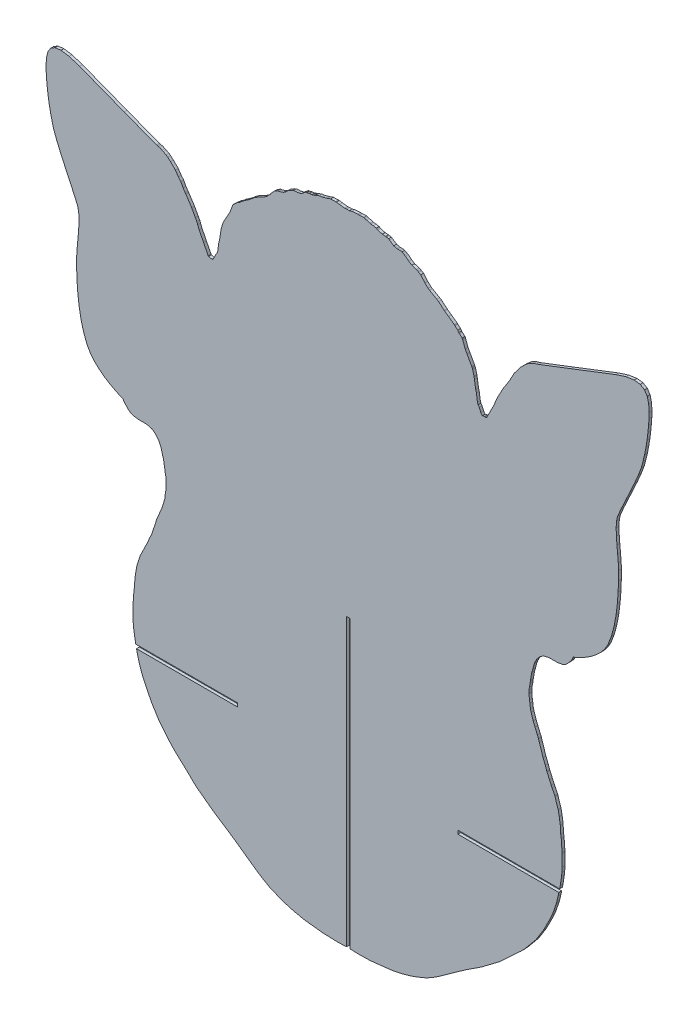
from build123d import *

# Parameters (mm, degrees)
EXTRUDE_1_DEPTH = 2


with BuildPart() as part:
    # Model → Extrude 1 (new body)
    with BuildSketch(Plane.XY):
        Polygon((-5480.3282, -943.7003), (-5481.4679, -943.914), (-5484.9872, -944.6862), (-5485.7073, -944.8046), (-5489.5797, -945.2389), (-5498.2966, -946.2631), (-5502.5798, -946.5819), (-5509.2475, -946.6767), (-5509.9731, -946.6588), (-5510.6986, -946.641), (-5515.4684, -946.5092), (-5515.4684, -744.1046), (-5515.7184, -744.1046), (-5517.7184, -744.1046), (-5517.9684, -744.1046), (-5517.9684, -946.5093), (-5518.7211, -946.5311), (-5524.7654, -946.6789), (-5529.1477, -946.5209), (-5532.9642, -946.3952), (-5533.209, -946.4022), (-5533.4537, -946.4093), (-5534.1791, -946.3847), (-5547.6379, -944.8563), (-5548.7945, -944.6618), (-5551.8003, -943.9579), (-5554.9713, -943.3454), (-5560.0283, -941.9174), (-5562.8963, -940.9633), (-5565.7023, -939.9208), (-5572.2742, -937.2243), (-5572.3351, -937.193), (-5572.3961, -937.1618), (-5577.7333, -934.049), (-5580.4381, -932.31), (-5584.6052, -929.391), (-5594.3396, -922.4525), (-5598.0301, -919.9132), (-5601.2709, -917.6901), (-5609.4952, -912.3563), (-5613.0819, -909.8378), (-5618.4548, -905.8397), (-5623.7762, -901.9018), (-5625.6459, -900.267), (-5628.2134, -897.706), (-5639.4595, -887.1359), (-5641.9636, -884.598), (-5642.1928, -884.3131), (-5642.422, -884.0285), (-5642.956, -883.4528), (-5648.5054, -876.7374), (-5650.1177, -874.8195), (-5650.2498, -874.6527), (-5650.3819, -874.4862), (-5650.5482, -874.2538), (-5655.548, -866.2121), (-5655.7403, -865.872), (-5655.9327, -865.5321), (-5659.6792, -858.1508), (-5661.7837, -853.7121), (-5662.8868, -850.8329), (-5664.802, -845.0885), (-5665.1398, -843.8568), (-5666.0983, -839.8727), (-5666.465, -838.1151), (-5595.0964, -838.1151), (-5595.0964, -837.8651), (-5595.0964, -835.8651), (-5595.0964, -835.6151), (-5666.9868, -835.6151), (-5667.5786, -832.7787), (-5668.5532, -826.4984), (-5668.7746, -824.0397), (-5668.9908, -820.8112), (-5668.9731, -812.4186), (-5668.9436, -811.4315), (-5668.7493, -809.736), (-5668.3181, -803.518), (-5667.9446, -801.1095), (-5667.6075, -795.5792), (-5666.902, -790.819), (-5666.159, -787.0126), (-5663.9006, -780.0443), (-5663.8545, -779.8974), (-5663.7923, -779.7201), (-5663.7233, -779.5624), (-5661.8575, -775.6896), (-5658.0781, -767.8864), (-5657.5495, -766.4398), (-5655.4711, -761.8165), (-5652.8164, -753.7411), (-5652.3174, -752.0829), (-5652.2287, -751.7782), (-5652.167, -751.6234), (-5651.4176, -749.8839), (-5649.7695, -745.9193), (-5648.4568, -742.8124), (-5647.0221, -738.2016), (-5646.525, -736.402), (-5646.1612, -733.2125), (-5645.8202, -731.3319), (-5645.5793, -727.8876), (-5645.51, -724.1242), (-5645.8216, -722.0116), (-5646.3486, -719.3195), (-5646.4325, -718.2033), (-5646.5751, -717.341), (-5647.464, -712.3627), (-5648.1461, -709.9806), (-5649.1175, -706.2814), (-5649.7402, -704.7699), (-5650.8364, -702.5658), (-5651.0222, -702.3151), (-5651.208, -702.0644), (-5653.1512, -699.7926), (-5653.2987, -699.6356), (-5653.3936, -699.5912), (-5653.4885, -699.547), (-5655.5515, -698.0504), (-5658.9829, -697.1823), (-5659.2673, -697.1222), (-5659.5516, -697.0624), (-5663.3475, -697.036), (-5665.6954, -696.9938), (-5669.3225, -696.3642), (-5669.5002, -696.3197), (-5669.678, -696.2755), (-5670.0395, -696.1017), (-5670.401, -695.9279), (-5671.8032, -694.9801), (-5672.995, -693.7836), (-5675.2873, -691.2702), (-5675.8777, -690.2272), (-5676.0145, -689.9254), (-5680.4875, -687.9752), (-5684.8447, -685.7033), (-5688.9852, -683.1127), (-5692.8074, -680.2062), (-5696.2102, -676.9867), (-5699.0921, -673.4577), (-5701.3524, -669.6215), (-5703.8401, -663.1244), (-5705.722, -656.0656), (-5707.0797, -648.6776), (-5707.9941, -641.1933), (-5708.5466, -633.8449), (-5708.8183, -626.8654), (-5708.891, -620.4872), (-5708.6495, -615.901), (-5708.208, -610.8058), (-5707.7146, -605.4828), (-5707.3166, -600.2123), (-5707.1621, -595.275), (-5707.3987, -590.952), (-5708.1744, -587.5241), (-5710.7914, -581.6146), (-5713.8507, -575.0158), (-5717.0757, -568.1154), (-5720.189, -561.3007), (-5722.9137, -554.9591), (-5724.9726, -549.4784), (-5726.089, -545.2455), (-5727.2274, -540.5304), (-5728.2004, -535.5941), (-5729.0046, -530.5895), (-5729.6358, -525.6693), (-5730.0913, -520.9862), (-5730.3669, -516.6928), (-5730.4597, -512.942), (-5730.1595, -507.8295), (-5729.1362, -503.7047), (-5727.2065, -500.6715), (-5724.1858, -498.8336), (-5719.8906, -498.2956), (-5714.1369, -499.1608), (-5706.7412, -501.5338), (-5675.2114, -513.7157), (-5652.416, -522.4633), (-5652.1168, -522.5675), (-5651.6053, -522.6749), (-5651.0937, -522.7824), (-5649.979, -523.0319), (-5649.2732, -523.381), (-5648.5674, -523.7301), (-5648.5332, -523.747), (-5648.499, -523.7638), (-5647.5491, -524.2169), (-5645.5957, -525.202), (-5644.4646, -526.0116), (-5642.4383, -527.8129), (-5639.0272, -531.171), (-5636.8758, -534.3612), (-5635.2434, -536.2531), (-5633.5255, -539.4433), (-5632.1069, -541.5485), (-5631.9238, -541.7914), (-5631.7407, -542.0343), (-5631.5747, -542.2726), (-5627.4895, -548.5265), (-5624.8483, -553.3466), (-5623.8199, -555.2082), (-5623.2071, -556.8449), (-5622.1518, -559.4469), (-5619.1284, -565.5426), (-5615.6935, -572.2125), (-5615.4671, -572.381), (-5613.0804, -572.9745), (-5612.5066, -572.5587), (-5611.5085, -571.1898), (-5610.2656, -568.2748), (-5609.4736, -567.2489), (-5609.0764, -565.9818), (-5608.3153, -560.6142), (-5607.816, -558.6759), (-5606.9321, -553.0231), (-5606.7108, -551.6371), (-5606.6318, -551.1774), (-5605.6759, -547.5839), (-5605.4305, -546.9247), (-5605.2952, -546.5746), (-5605.1487, -546.3014), (-5605.0179, -545.9645), (-5601.6704, -540.007), (-5600.3481, -537.5839), (-5598.5994, -532.7929), (-5598.3504, -532.2145), (-5598.1966, -531.9672), (-5596.3104, -530.3249), (-5594.7095, -528.8905), (-5593.4126, -528.1823), (-5591.2128, -526.265), (-5587.1687, -523.4701), (-5586.6991, -523.1644), (-5586.4299, -522.9132), (-5583.0069, -520.0895), (-5581.8462, -519.339), (-5579.5425, -518.0402), (-5576.7533, -516.5917), (-5576.5129, -516.4533), (-5576.2724, -516.3151), (-5574.8093, -515.2897), (-5574.6136, -515.1815), (-5574.4518, -515.0529), (-5572.1304, -512.8292), (-5571.2109, -511.5375), (-5569.6971, -509.8444), (-5569.0637, -509.2201), (-5568.686, -509.036), (-5566.5963, -507.6898), (-5565.8568, -507.6808), (-5565.452, -507.6134), (-5562.5886, -506.6593), (-5561.1531, -505.692), (-5559.7425, -504.35), (-5558.6138, -503.5202), (-5556.6302, -502.4772), (-5556.5691, -502.4633), (-5556.508, -502.4494), (-5555.5853, -501.9962), (-5553.8155, -501.7455), (-5552.7667, -501.7689), (-5551.7705, -501.6308), (-5549.9726, -501.1449), (-5549.9502, -501.1361), (-5549.6855, -500.9801), (-5546.6116, -498.5597), (-5546.0011, -498.6186), (-5544.7883, -498.348), (-5544.3656, -498.194), (-5544.1094, -498.1881), (-5543.8533, -498.1825), (-5543.1493, -498.1383), (-5542.4454, -498.0941), (-5541.1514, -497.4599), (-5540.2858, -497.3878), (-5538.978, -496.7028), (-5537.2081, -496.0883), (-5535.7148, -495.9415), (-5534.6709, -495.6962), (-5532.417, -495.0722), (-5531.8631, -494.8859), (-5531.3093, -494.6996), (-5529.1798, -493.9962), (-5525.833, -493.9545), (-5525.733, -493.9601), (-5525.633, -493.9657), (-5525.1904, -493.9069), (-5524.9759, -493.9481), (-5522.79, -494.254), (-5519.3476, -494.6776), (-5518.5047, -494.6298), (-5517.6619, -494.5822), (-5515.9836, -494.5832), (-5514.1221, -494.0775), (-5510.2135, -493.7782), (-5509.4335, -493.8793), (-5509.1186, -493.8585), (-5508.8038, -493.8378), (-5505.6023, -493.6198), (-5504.7429, -493.9181), (-5503.8835, -494.2165), (-5501.4905, -495.0177), (-5501.0812, -495.1391), (-5500.672, -495.2604), (-5499.0441, -495.3317), (-5496.8858, -495.7814), (-5496.3353, -496.0739), (-5495.7848, -496.3666), (-5492.9171, -497.2758), (-5492.7713, -497.3368), (-5492.5653, -497.3466), (-5492.3592, -497.3563), (-5491.4593, -497.4127), (-5490.5594, -497.4691), (-5490.3032, -497.475), (-5490.047, -497.4809), (-5489.8356, -497.5578), (-5489.6243, -497.6347), (-5488.2986, -497.9306), (-5487.649, -498.3234), (-5484.5294, -500.4074), (-5483.5857, -500.6625), (-5482.6421, -500.9176), (-5482.144, -500.9867), (-5481.646, -501.0558), (-5480.5972, -501.0324), (-5479.7123, -501.1576), (-5478.8274, -501.2831), (-5478.311, -501.5365), (-5477.7945, -501.7902), (-5477.0722, -502.1674), (-5476.3498, -502.5446), (-5473.9863, -504.4892), (-5471.8242, -505.9462), (-5468.7329, -506.976), (-5468.1564, -507.1933), (-5467.5099, -507.4064), (-5466.9015, -507.778), (-5465.4761, -508.6779), (-5462.5572, -512.0707), (-5462.495, -512.1395), (-5462.4327, -512.2086), (-5460.2757, -514.2421), (-5459.7505, -514.61), (-5459.2253, -514.9779), (-5454.1313, -517.9074), (-5452.8856, -518.6735), (-5448.7702, -522.1593), (-5448.659, -522.2489), (-5448.5409, -522.3737), (-5445.9202, -524.2082), (-5441.748, -527.2067), (-5441.5055, -527.4774), (-5441.263, -527.7484), (-5439.318, -529.4301), (-5438.5392, -530.6466), (-5438.3207, -530.8424), (-5438.1022, -531.0382), (-5436.216, -532.6806), (-5436.1392, -532.8041), (-5436.0624, -532.9276), (-5435.9379, -533.2169), (-5435.8133, -533.5062), (-5434.0646, -538.2973), (-5432.7422, -540.7204), (-5429.3948, -546.6779), (-5429.3294, -546.8463), (-5429.264, -547.0148), (-5429.1174, -547.288), (-5429.0497, -547.4628), (-5428.982, -547.6378), (-5428.7369, -548.2973), (-5427.7809, -551.8905), (-5427.7018, -552.3502), (-5427.4806, -553.7365), (-5426.5968, -559.3893), (-5426.0974, -561.3275), (-5425.3363, -566.6952), (-5424.9391, -567.9621), (-5424.1472, -568.9882), (-5422.9042, -571.9032), (-5421.9475, -573.2155), (-5421.0318, -572.9997), (-5420.1161, -572.7841), (-5419.7261, -572.8874), (-5419.336, -572.9906), (-5418.79, -572.6032), (-5418.017, -571.0536), (-5413.3276, -561.9149), (-5412.4836, -559.4694), (-5411.0215, -556.182), (-5407.9211, -550.5192), (-5407.3613, -549.4335), (-5406.9536, -548.7411), (-5403.0954, -542.7123), (-5403.0553, -542.6544), (-5403.0152, -542.5966), (-5402.9324, -542.4853), (-5402.8496, -542.3742), (-5399.1693, -535.5397), (-5397.5367, -533.6478), (-5395.3855, -530.4579), (-5391.9742, -527.0998), (-5389.9482, -525.2985), (-5389.3826, -524.8937), (-5388.817, -524.4889), (-5386.8636, -523.5036), (-5385.2971, -522.7562), (-5383.4862, -522.2697), (-5381.9968, -521.7499), (-5359.2013, -513.0026), (-5327.6714, -500.8205), (-5320.2755, -498.4474), (-5314.5221, -497.5822), (-5310.227, -498.1205), (-5307.2063, -499.9582), (-5305.2764, -502.9916), (-5304.2532, -507.1164), (-5303.953, -512.2287), (-5304.0456, -515.9794), (-5304.3213, -520.2728), (-5304.7767, -524.956), (-5305.4082, -529.8764), (-5306.2121, -534.881), (-5307.185, -539.817), (-5308.3236, -544.5324), (-5309.4398, -548.765), (-5311.4988, -554.2457), (-5314.2237, -560.5873), (-5317.3371, -567.4022), (-5320.562, -574.3026), (-5323.6213, -580.9013), (-5326.2383, -586.8109), (-5327.0139, -590.2389), (-5327.2505, -594.5617), (-5327.0961, -599.4989), (-5326.6981, -604.7694), (-5326.2046, -610.0927), (-5325.7632, -615.1876), (-5325.5217, -619.7738), (-5325.5941, -626.152), (-5325.866, -633.1317), (-5326.4186, -640.4801), (-5327.333, -647.9645), (-5328.6905, -655.3524), (-5330.5723, -662.4113), (-5333.0602, -668.9083), (-5335.2554, -672.6515), (-5338.0441, -676.1034), (-5341.3325, -679.2609), (-5345.0268, -682.1212), (-5349.0332, -684.6818), (-5353.2578, -686.9396), (-5357.6069, -688.892), (-5358.535, -690.9406), (-5359.1252, -691.9835), (-5361.4177, -694.497), (-5362.6095, -695.6935), (-5364.0116, -696.6413), (-5364.7347, -696.9887), (-5364.9125, -697.0331), (-5365.0903, -697.0775), (-5368.7171, -697.7072), (-5371.0652, -697.7492), (-5374.8611, -697.7758), (-5375.4299, -697.8954), (-5378.8612, -698.7636), (-5380.9243, -700.2604), (-5381.0192, -700.3046), (-5381.1141, -700.3488), (-5381.2615, -700.5058), (-5383.2046, -702.7777), (-5383.3904, -703.0282), (-5383.5762, -703.279), (-5384.6723, -705.4833), (-5385.2952, -706.9948), (-5386.2666, -710.6937), (-5386.9486, -713.0758), (-5387.8376, -718.0541), (-5387.9802, -718.9166), (-5388.0641, -720.0329), (-5388.591, -722.7248), (-5388.9028, -724.8375), (-5388.8749, -726.3441), (-5388.8483, -726.964), (-5388.5924, -730.6188), (-5388.2513, -732.4992), (-5387.8877, -735.6886), (-5387.3906, -737.4882), (-5385.956, -742.099), (-5384.6431, -745.2062), (-5382.995, -749.1706), (-5382.2457, -750.9101), (-5382.1838, -751.0648), (-5382.0953, -751.3695), (-5381.5963, -753.0277), (-5378.9416, -761.1032), (-5377.37, -764.976), (-5376.3668, -767.9218), (-5376.2588, -768.1789), (-5376.1507, -768.4362), (-5374.3494, -772.4123), (-5373.1434, -775.1884), (-5372.5552, -776.4027), (-5370.6894, -780.2758), (-5370.6203, -780.4335), (-5370.5893, -780.5221), (-5370.5582, -780.6107), (-5370.5121, -780.7577), (-5368.2538, -787.7257), (-5367.5106, -791.5324), (-5366.805, -796.2924), (-5366.468, -801.8227), (-5366.0946, -804.2313), (-5365.6634, -810.4494), (-5365.4691, -812.1447), (-5365.4394, -813.1317), (-5365.4219, -821.5246), (-5365.6379, -824.7531), (-5365.8594, -827.2116), (-5366.8341, -833.4918), (-5367.2771, -835.6151), (-5439.1573, -835.6151), (-5439.1573, -835.8651), (-5439.1573, -837.8651), (-5439.1573, -838.1151), (-5367.799, -838.1151), (-5368.3146, -840.5858), (-5369.2728, -844.57), (-5369.6108, -845.8017), (-5371.5259, -851.546), (-5372.629, -854.4252), (-5374.7335, -858.8642), (-5378.48, -866.2455), (-5378.6723, -866.5853), (-5378.8646, -866.9252), (-5383.8645, -874.9672), (-5384.0307, -875.1996), (-5384.1629, -875.3661), (-5384.2952, -875.5326), (-5385.9075, -877.4506), (-5391.4567, -884.1659), (-5391.794, -884.5297), (-5392.1313, -884.8935), (-5394.4651, -887.3375), (-5408.6326, -900.4403), (-5408.9615, -900.7621), (-5409.2905, -901.0841), (-5410.0699, -901.7604), (-5411.4541, -902.7545), (-5415.3446, -905.7182), (-5421.7142, -910.4901), (-5422.0406, -910.7548), (-5422.3671, -911.0197), (-5422.7446, -911.2924), (-5426.5004, -913.7289), (-5432.6655, -917.7572), (-5435.5454, -919.7653), (-5439.3135, -922.3795), (-5449.281, -929.5612), (-5453.1617, -932.3202), (-5455.7375, -933.984), (-5461.1759, -937.1879), (-5461.1989, -937.1994), (-5461.2219, -937.2108), (-5467.5879, -939.8227), (-5470.4944, -940.9137), (-5473.225, -941.8048), (-5479.1886, -943.4867), align=None)
    extrude(amount=EXTRUDE_1_DEPTH)


solid = part.part
